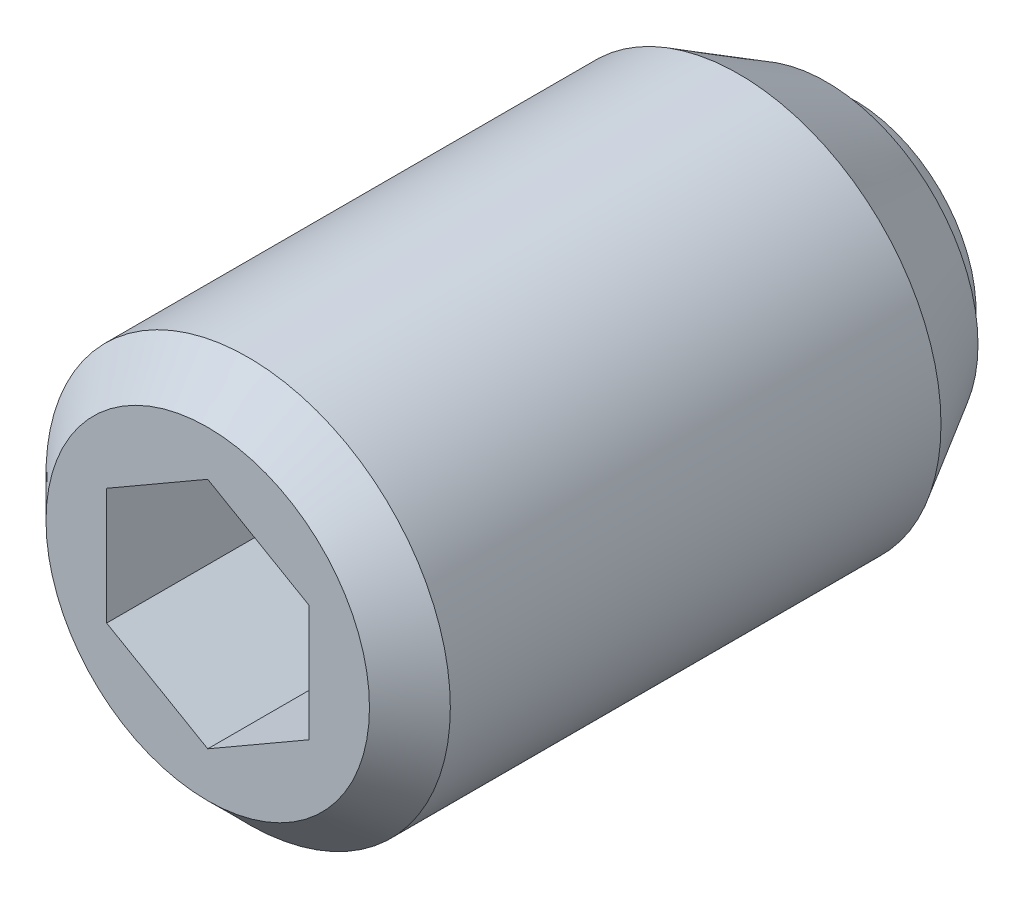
ISO-10303-21;
HEADER;
FILE_DESCRIPTION(('STEP AP214'),'2;1');
FILE_NAME('part.step','',(''),(''),'','','');
FILE_SCHEMA(('AUTOMOTIVE_DESIGN { 1 0 10303 214 1 1 1 1 }'));
ENDSEC;
DATA;
#1=APPLICATION_CONTEXT('core data for automotive mechanical design processes');
#2=APPLICATION_PROTOCOL_DEFINITION('international standard','automotive_design',2000,#1);
#3=PRODUCT_CONTEXT('',#1,'mechanical');
#4=PRODUCT('Part','Part','',(#3));
#5=PRODUCT_RELATED_PRODUCT_CATEGORY('part','',(#4));
#6=PRODUCT_DEFINITION_FORMATION('','',#4);
#7=PRODUCT_DEFINITION_CONTEXT('part definition',#1,'design');
#8=PRODUCT_DEFINITION('design','',#6,#7);
#9=PRODUCT_DEFINITION_SHAPE('','',#8);
#10=(LENGTH_UNIT() NAMED_UNIT(*) SI_UNIT(.MILLI.,.METRE.));
#11=(NAMED_UNIT(*) PLANE_ANGLE_UNIT() SI_UNIT($,.RADIAN.));
#12=(NAMED_UNIT(*) SI_UNIT($,.STERADIAN.) SOLID_ANGLE_UNIT());
#13=UNCERTAINTY_MEASURE_WITH_UNIT(LENGTH_MEASURE(1.E-05),#10,'distance_accuracy_value','');
#14=(GEOMETRIC_REPRESENTATION_CONTEXT(3) GLOBAL_UNCERTAINTY_ASSIGNED_CONTEXT((#13)) GLOBAL_UNIT_ASSIGNED_CONTEXT((#10,
#11,#12)) REPRESENTATION_CONTEXT('',''));
#15=CARTESIAN_POINT('',(0.,0.,0.));
#16=DIRECTION('',(0.,0.,1.));
#17=DIRECTION('',(1.,0.,0.));
#18=AXIS2_PLACEMENT_3D('',#15,#16,#17);
#19=CARTESIAN_POINT('',(2.5,1.44337567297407,13.5));
#20=DIRECTION('',(0.5,0.86602540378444,0.));
#21=DIRECTION('',(0.86602540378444,-0.5,0.));
#22=AXIS2_PLACEMENT_3D('',#19,#20,#21);
#23=PLANE('',#22);
#24=DIRECTION('',(0.,0.,1.));
#25=VECTOR('',#24,1.);
#26=CARTESIAN_POINT('',(2.5,1.44337567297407,13.5));
#27=LINE('',#26,#25);
#28=CARTESIAN_POINT('',(2.5,1.44337567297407,12.));
#29=VERTEX_POINT('',#28);
#30=CARTESIAN_POINT('',(2.5,1.44337567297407,16.));
#31=VERTEX_POINT('',#30);
#32=EDGE_CURVE('E68',#29,#31,#27,.T.);
#33=ORIENTED_EDGE('',*,*,#32,.T.);
#34=DIRECTION('',(-0.86602540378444,0.5,0.));
#35=VECTOR('',#34,1.);
#36=CARTESIAN_POINT('',(2.5,1.44337567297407,16.));
#37=LINE('',#36,#35);
#38=CARTESIAN_POINT('',(0.,2.88675134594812,16.));
#39=VERTEX_POINT('',#38);
#40=EDGE_CURVE('E29',#31,#39,#37,.T.);
#41=ORIENTED_EDGE('',*,*,#40,.T.);
#42=DIRECTION('',(0.,0.,1.));
#43=VECTOR('',#42,1.);
#44=CARTESIAN_POINT('',(0.,2.88675134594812,13.5));
#45=LINE('',#44,#43);
#46=CARTESIAN_POINT('',(0.,2.88675134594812,12.));
#47=VERTEX_POINT('',#46);
#48=EDGE_CURVE('E80',#47,#39,#45,.T.);
#49=ORIENTED_EDGE('',*,*,#48,.F.);
#50=DIRECTION('',(-0.86602540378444,0.5,0.));
#51=VECTOR('',#50,1.);
#52=CARTESIAN_POINT('',(2.5,1.44337567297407,12.));
#53=LINE('',#52,#51);
#54=EDGE_CURVE('E79',#29,#47,#53,.T.);
#55=ORIENTED_EDGE('',*,*,#54,.F.);
#56=EDGE_LOOP('',(#33,#41,#49,#55));
#57=FACE_BOUND('',#56,.T.);
#58=ADVANCED_FACE('F14',(#57),#23,.F.);
#59=CARTESIAN_POINT('',(2.5,-1.44337567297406,13.5));
#60=DIRECTION('',(1.,0.,0.));
#61=DIRECTION('',(0.,-1.,0.));
#62=AXIS2_PLACEMENT_3D('',#59,#60,#61);
#63=PLANE('',#62);
#64=DIRECTION('',(0.,0.,1.));
#65=VECTOR('',#64,1.);
#66=CARTESIAN_POINT('',(2.5,-1.44337567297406,13.5));
#67=LINE('',#66,#65);
#68=CARTESIAN_POINT('',(2.5,-1.44337567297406,12.));
#69=VERTEX_POINT('',#68);
#70=CARTESIAN_POINT('',(2.5,-1.44337567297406,16.));
#71=VERTEX_POINT('',#70);
#72=EDGE_CURVE('E76',#69,#71,#67,.T.);
#73=ORIENTED_EDGE('',*,*,#72,.T.);
#74=DIRECTION('',(0.,1.,0.));
#75=VECTOR('',#74,1.);
#76=CARTESIAN_POINT('',(2.5,-1.44337567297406,16.));
#77=LINE('',#76,#75);
#78=EDGE_CURVE('E75',#71,#31,#77,.T.);
#79=ORIENTED_EDGE('',*,*,#78,.T.);
#80=ORIENTED_EDGE('',*,*,#32,.F.);
#81=DIRECTION('',(0.,1.,0.));
#82=VECTOR('',#81,1.);
#83=CARTESIAN_POINT('',(2.5,-1.44337567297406,12.));
#84=LINE('',#83,#82);
#85=EDGE_CURVE('E72',#69,#29,#84,.T.);
#86=ORIENTED_EDGE('',*,*,#85,.F.);
#87=EDGE_LOOP('',(#73,#79,#80,#86));
#88=FACE_BOUND('',#87,.T.);
#89=ADVANCED_FACE('F70',(#88),#63,.F.);
#90=CARTESIAN_POINT('',(2.5,-1.44337567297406,13.5));
#91=DIRECTION('',(-0.5,0.866025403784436,0.));
#92=DIRECTION('',(0.866025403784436,0.5,0.));
#93=AXIS2_PLACEMENT_3D('',#90,#91,#92);
#94=PLANE('',#93);
#95=DIRECTION('',(0.,0.,1.));
#96=VECTOR('',#95,1.);
#97=CARTESIAN_POINT('',(0.,-2.88675134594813,13.5));
#98=LINE('',#97,#96);
#99=CARTESIAN_POINT('',(0.,-2.88675134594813,12.));
#100=VERTEX_POINT('',#99);
#101=CARTESIAN_POINT('',(0.,-2.88675134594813,16.));
#102=VERTEX_POINT('',#101);
#103=EDGE_CURVE('E122',#100,#102,#98,.T.);
#104=ORIENTED_EDGE('',*,*,#103,.T.);
#105=DIRECTION('',(-0.866025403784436,-0.5,0.));
#106=VECTOR('',#105,1.);
#107=CARTESIAN_POINT('',(2.5,-1.44337567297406,16.));
#108=LINE('',#107,#106);
#109=EDGE_CURVE('E113',#71,#102,#108,.T.);
#110=ORIENTED_EDGE('',*,*,#109,.F.);
#111=ORIENTED_EDGE('',*,*,#72,.F.);
#112=DIRECTION('',(0.866025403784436,0.5,0.));
#113=VECTOR('',#112,1.);
#114=CARTESIAN_POINT('',(0.,-2.88675134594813,12.));
#115=LINE('',#114,#113);
#116=EDGE_CURVE('E89',#100,#69,#115,.T.);
#117=ORIENTED_EDGE('',*,*,#116,.F.);
#118=EDGE_LOOP('',(#104,#110,#111,#117));
#119=FACE_BOUND('',#118,.T.);
#120=ADVANCED_FACE('F147',(#119),#94,.T.);
#121=CARTESIAN_POINT('',(-2.5,-1.44337567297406,13.5));
#122=DIRECTION('',(-0.5,-0.866025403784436,0.));
#123=DIRECTION('',(-0.866025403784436,0.5,0.));
#124=AXIS2_PLACEMENT_3D('',#121,#122,#123);
#125=PLANE('',#124);
#126=DIRECTION('',(0.,0.,1.));
#127=VECTOR('',#126,1.);
#128=CARTESIAN_POINT('',(-2.5,-1.44337567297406,13.5));
#129=LINE('',#128,#127);
#130=CARTESIAN_POINT('',(-2.5,-1.44337567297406,12.));
#131=VERTEX_POINT('',#130);
#132=CARTESIAN_POINT('',(-2.5,-1.44337567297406,16.));
#133=VERTEX_POINT('',#132);
#134=EDGE_CURVE('E120',#131,#133,#129,.T.);
#135=ORIENTED_EDGE('',*,*,#134,.T.);
#136=DIRECTION('',(0.866025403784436,-0.5,0.));
#137=VECTOR('',#136,1.);
#138=CARTESIAN_POINT('',(-2.5,-1.44337567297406,16.));
#139=LINE('',#138,#137);
#140=EDGE_CURVE('E111',#133,#102,#139,.T.);
#141=ORIENTED_EDGE('',*,*,#140,.T.);
#142=ORIENTED_EDGE('',*,*,#103,.F.);
#143=DIRECTION('',(0.866025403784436,-0.5,0.));
#144=VECTOR('',#143,1.);
#145=CARTESIAN_POINT('',(-2.5,-1.44337567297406,12.));
#146=LINE('',#145,#144);
#147=EDGE_CURVE('E101',#131,#100,#146,.T.);
#148=ORIENTED_EDGE('',*,*,#147,.F.);
#149=EDGE_LOOP('',(#135,#141,#142,#148));
#150=FACE_BOUND('',#149,.T.);
#151=ADVANCED_FACE('F157',(#150),#125,.F.);
#152=CARTESIAN_POINT('',(-2.5,-1.44337567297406,13.5));
#153=DIRECTION('',(1.,0.,0.));
#154=DIRECTION('',(0.,-1.,0.));
#155=AXIS2_PLACEMENT_3D('',#152,#153,#154);
#156=PLANE('',#155);
#157=DIRECTION('',(0.,0.,1.));
#158=VECTOR('',#157,1.);
#159=CARTESIAN_POINT('',(-2.5,1.44337567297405,13.5));
#160=LINE('',#159,#158);
#161=CARTESIAN_POINT('',(-2.5,1.44337567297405,12.));
#162=VERTEX_POINT('',#161);
#163=CARTESIAN_POINT('',(-2.5,1.44337567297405,16.));
#164=VERTEX_POINT('',#163);
#165=EDGE_CURVE('E37',#162,#164,#160,.T.);
#166=ORIENTED_EDGE('',*,*,#165,.T.);
#167=DIRECTION('',(0.,1.,0.));
#168=VECTOR('',#167,1.);
#169=CARTESIAN_POINT('',(-2.5,-1.44337567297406,16.));
#170=LINE('',#169,#168);
#171=EDGE_CURVE('E108',#133,#164,#170,.T.);
#172=ORIENTED_EDGE('',*,*,#171,.F.);
#173=ORIENTED_EDGE('',*,*,#134,.F.);
#174=DIRECTION('',(0.,-1.,0.));
#175=VECTOR('',#174,1.);
#176=CARTESIAN_POINT('',(-2.5,1.44337567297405,12.));
#177=LINE('',#176,#175);
#178=EDGE_CURVE('E98',#162,#131,#177,.T.);
#179=ORIENTED_EDGE('',*,*,#178,.F.);
#180=EDGE_LOOP('',(#166,#172,#173,#179));
#181=FACE_BOUND('',#180,.T.);
#182=ADVANCED_FACE('F153',(#181),#156,.T.);
#183=CARTESIAN_POINT('',(-2.5,1.44337567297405,13.5));
#184=DIRECTION('',(0.5,-0.866025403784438,0.));
#185=DIRECTION('',(-0.866025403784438,-0.5,0.));
#186=AXIS2_PLACEMENT_3D('',#183,#184,#185);
#187=PLANE('',#186);
#188=ORIENTED_EDGE('',*,*,#165,.F.);
#189=DIRECTION('',(-0.866025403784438,-0.5,0.));
#190=VECTOR('',#189,1.);
#191=CARTESIAN_POINT('',(0.,2.88675134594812,12.));
#192=LINE('',#191,#190);
#193=EDGE_CURVE('E84',#47,#162,#192,.T.);
#194=ORIENTED_EDGE('',*,*,#193,.F.);
#195=ORIENTED_EDGE('',*,*,#48,.T.);
#196=DIRECTION('',(0.866025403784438,0.5,0.));
#197=VECTOR('',#196,1.);
#198=CARTESIAN_POINT('',(-2.5,1.44337567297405,16.));
#199=LINE('',#198,#197);
#200=EDGE_CURVE('E105',#164,#39,#199,.T.);
#201=ORIENTED_EDGE('',*,*,#200,.F.);
#202=EDGE_LOOP('',(#188,#194,#195,#201));
#203=FACE_BOUND('',#202,.T.);
#204=ADVANCED_FACE('F150',(#203),#187,.T.);
#205=CARTESIAN_POINT('',(0.,0.,15.75));
#206=DIRECTION('',(0.,0.,-1.));
#207=DIRECTION('',(1.,0.,0.));
#208=AXIS2_PLACEMENT_3D('',#205,#206,#207);
#209=CYLINDRICAL_SURFACE('',#208,5.);
#210=CARTESIAN_POINT('',(0.,0.,15.));
#211=DIRECTION('',(0.,0.,-1.));
#212=DIRECTION('',(1.,0.,0.));
#213=AXIS2_PLACEMENT_3D('',#210,#211,#212);
#214=CIRCLE('',#213,5.);
#215=CARTESIAN_POINT('',(5.,0.,15.));
#216=VERTEX_POINT('',#215);
#217=EDGE_CURVE('E9',#216,#216,#214,.T.);
#218=ORIENTED_EDGE('',*,*,#217,.T.);
#219=EDGE_LOOP('',(#218));
#220=FACE_BOUND('',#219,.T.);
#221=CARTESIAN_POINT('',(0.,0.,2.86506350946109));
#222=DIRECTION('',(0.,0.,-1.));
#223=DIRECTION('',(-1.,0.,0.));
#224=AXIS2_PLACEMENT_3D('',#221,#222,#223);
#225=CIRCLE('',#224,5.);
#226=CARTESIAN_POINT('',(-5.,0.,2.86506350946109));
#227=VERTEX_POINT('',#226);
#228=EDGE_CURVE('E260',#227,#227,#225,.T.);
#229=ORIENTED_EDGE('',*,*,#228,.F.);
#230=EDGE_LOOP('',(#229));
#231=FACE_BOUND('',#230,.T.);
#232=ADVANCED_FACE('F16',(#220,#231),#209,.T.);
#233=CARTESIAN_POINT('',(0.,0.,15.));
#234=DIRECTION('',(0.,0.,-1.));
#235=DIRECTION('',(1.,0.,0.));
#236=AXIS2_PLACEMENT_3D('',#233,#234,#235);
#237=CONICAL_SURFACE('',#236,5.,0.785398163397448);
#238=CARTESIAN_POINT('',(0.,0.,16.));
#239=DIRECTION('',(0.,0.,-1.));
#240=DIRECTION('',(1.,0.,0.));
#241=AXIS2_PLACEMENT_3D('',#238,#239,#240);
#242=CIRCLE('',#241,4.);
#243=CARTESIAN_POINT('',(4.,0.,16.));
#244=VERTEX_POINT('',#243);
#245=EDGE_CURVE('E22',#244,#244,#242,.T.);
#246=ORIENTED_EDGE('',*,*,#245,.T.);
#247=EDGE_LOOP('',(#246));
#248=FACE_BOUND('',#247,.T.);
#249=ORIENTED_EDGE('',*,*,#217,.F.);
#250=EDGE_LOOP('',(#249));
#251=FACE_BOUND('',#250,.T.);
#252=ADVANCED_FACE('F127',(#248,#251),#237,.T.);
#253=CARTESIAN_POINT('',(0.,0.,16.));
#254=DIRECTION('',(0.,0.,-1.));
#255=DIRECTION('',(1.,0.,0.));
#256=AXIS2_PLACEMENT_3D('',#253,#254,#255);
#257=PLANE('',#256);
#258=ORIENTED_EDGE('',*,*,#200,.T.);
#259=ORIENTED_EDGE('',*,*,#40,.F.);
#260=ORIENTED_EDGE('',*,*,#78,.F.);
#261=ORIENTED_EDGE('',*,*,#109,.T.);
#262=ORIENTED_EDGE('',*,*,#140,.F.);
#263=ORIENTED_EDGE('',*,*,#171,.T.);
#264=EDGE_LOOP('',(#258,#259,#260,#261,#262,#263));
#265=FACE_BOUND('',#264,.T.);
#266=ORIENTED_EDGE('',*,*,#245,.F.);
#267=EDGE_LOOP('',(#266));
#268=FACE_BOUND('',#267,.T.);
#269=ADVANCED_FACE('F130',(#265,#268),#257,.F.);
#270=CARTESIAN_POINT('',(2.5,1.44337567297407,12.));
#271=DIRECTION('',(0.,0.,1.));
#272=DIRECTION('',(1.,0.,0.));
#273=AXIS2_PLACEMENT_3D('',#270,#271,#272);
#274=PLANE('',#273);
#275=ORIENTED_EDGE('',*,*,#85,.T.);
#276=ORIENTED_EDGE('',*,*,#54,.T.);
#277=ORIENTED_EDGE('',*,*,#193,.T.);
#278=ORIENTED_EDGE('',*,*,#178,.T.);
#279=ORIENTED_EDGE('',*,*,#147,.T.);
#280=ORIENTED_EDGE('',*,*,#116,.T.);
#281=EDGE_LOOP('',(#275,#276,#277,#278,#279,#280));
#282=FACE_BOUND('',#281,.T.);
#283=ADVANCED_FACE('F86',(#282),#274,.T.);
#284=CARTESIAN_POINT('',(0.,0.,0.));
#285=DIRECTION('',(0.,0.,-1.));
#286=DIRECTION('',(-1.,0.,0.));
#287=AXIS2_PLACEMENT_3D('',#284,#285,#286);
#288=PLANE('',#287);
#289=CARTESIAN_POINT('',(0.,0.,0.));
#290=DIRECTION('',(0.,0.,-1.));
#291=DIRECTION('',(-1.,0.,0.));
#292=AXIS2_PLACEMENT_3D('',#289,#290,#291);
#293=CIRCLE('',#292,3.00166620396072);
#294=CARTESIAN_POINT('',(-3.00166620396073,0.,0.));
#295=VERTEX_POINT('',#294);
#296=EDGE_CURVE('E90',#295,#295,#293,.T.);
#297=ORIENTED_EDGE('',*,*,#296,.T.);
#298=EDGE_LOOP('',(#297));
#299=FACE_BOUND('',#298,.T.);
#300=ADVANCED_FACE('F139',(#299),#288,.T.);
#301=CARTESIAN_POINT('',(0.,0.,1.8));
#302=DIRECTION('',(0.,0.,-1.));
#303=DIRECTION('',(-1.,0.,0.));
#304=AXIS2_PLACEMENT_3D('',#301,#302,#303);
#305=SPHERICAL_SURFACE('',#304,3.5);
#306=CARTESIAN_POINT('',(0.,0.,0.7));
#307=DIRECTION('',(0.,0.,-1.));
#308=DIRECTION('',(-1.,0.,0.));
#309=AXIS2_PLACEMENT_3D('',#306,#307,#308);
#310=CIRCLE('',#309,3.32264954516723);
#311=CARTESIAN_POINT('',(-3.32264954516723,0.,0.7));
#312=VERTEX_POINT('',#311);
#313=EDGE_CURVE('E93',#312,#312,#310,.T.);
#314=CARTESIAN_POINT('',(-3.32264954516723,0.,0.7));
#315=CARTESIAN_POINT('',(-3.32012332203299,0.,0.692369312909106));
#316=CARTESIAN_POINT('',(-3.31757081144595,0.,0.68474732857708));
#317=CARTESIAN_POINT('',(-3.31241333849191,0.,0.669521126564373));
#318=CARTESIAN_POINT('',(-3.30980837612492,0.,0.661916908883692));
#319=CARTESIAN_POINT('',(-3.30454612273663,0.,0.646726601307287));
#320=CARTESIAN_POINT('',(-3.30188883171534,0.,0.639140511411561));
#321=CARTESIAN_POINT('',(-3.29652204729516,0.,0.623986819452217));
#322=CARTESIAN_POINT('',(-3.29381255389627,0.,0.616419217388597));
#323=CARTESIAN_POINT('',(-3.28834149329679,0.,0.601302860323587));
#324=CARTESIAN_POINT('',(-3.28557992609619,0.,0.593754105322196));
#325=CARTESIAN_POINT('',(-3.28000484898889,0.,0.578675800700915));
#326=CARTESIAN_POINT('',(-3.27719133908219,0.,0.571146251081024));
#327=CARTESIAN_POINT('',(-3.27151251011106,0.,0.556106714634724));
#328=CARTESIAN_POINT('',(-3.26864719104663,0.,0.548596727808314));
#329=CARTESIAN_POINT('',(-3.26286487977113,0.,0.533596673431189));
#330=CARTESIAN_POINT('',(-3.25994788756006,0.,0.526106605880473));
#331=CARTESIAN_POINT('',(-3.25406236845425,0.,0.511146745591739));
#332=CARTESIAN_POINT('',(-3.25109384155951,0.,0.503676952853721));
#333=CARTESIAN_POINT('',(-3.24510539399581,0.,0.488757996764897));
#334=CARTESIAN_POINT('',(-3.24208547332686,0.,0.481308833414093));
#335=CARTESIAN_POINT('',(-3.23599438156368,0.,0.466431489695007));
#336=CARTESIAN_POINT('',(-3.23292321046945,0.,0.459003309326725));
#337=CARTESIAN_POINT('',(-3.22672976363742,0.,0.444168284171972));
#338=CARTESIAN_POINT('',(-3.22360748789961,0.,0.436761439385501));
#339=CARTESIAN_POINT('',(-3.21731197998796,0.,0.421969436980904));
#340=CARTESIAN_POINT('',(-3.2141387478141,0.,0.414584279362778));
#341=CARTESIAN_POINT('',(-3.20774147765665,0.,0.399836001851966));
#342=CARTESIAN_POINT('',(-3.20451743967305,0.,0.39247288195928));
#343=CARTESIAN_POINT('',(-3.19801871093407,0.,0.377769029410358));
#344=CARTESIAN_POINT('',(-3.19474402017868,0.,0.370428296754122));
#345=CARTESIAN_POINT('',(-3.18814414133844,0.,0.35576956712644));
#346=CARTESIAN_POINT('',(-3.18481895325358,0.,0.348451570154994));
#347=CARTESIAN_POINT('',(-3.17811823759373,0.,0.333838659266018));
#348=CARTESIAN_POINT('',(-3.17474271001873,0.,0.326543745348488));
#349=CARTESIAN_POINT('',(-3.16794147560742,0.,0.311977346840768));
#350=CARTESIAN_POINT('',(-3.1645157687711,0.,0.304705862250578));
#351=CARTESIAN_POINT('',(-3.15761433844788,0.,0.290186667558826));
#352=CARTESIAN_POINT('',(-3.15413861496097,0.,0.282938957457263));
#353=CARTESIAN_POINT('',(-3.14713731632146,0.,0.268467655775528));
#354=CARTESIAN_POINT('',(-3.14361174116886,0.,0.261244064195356));
#355=CARTESIAN_POINT('',(-3.13651090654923,0.,0.246821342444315));
#356=CARTESIAN_POINT('',(-3.13293564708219,0.,0.239622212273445));
#357=CARTESIAN_POINT('',(-3.12573561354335,0.,0.225248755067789));
#358=CARTESIAN_POINT('',(-3.12211083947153,0.,0.218074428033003));
#359=CARTESIAN_POINT('',(-3.11481194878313,0.,0.203750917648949));
#360=CARTESIAN_POINT('',(-3.11113783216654,0.,0.196601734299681));
#361=CARTESIAN_POINT('',(-3.10374043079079,0.,0.182328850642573));
#362=CARTESIAN_POINT('',(-3.10001714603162,0.,0.175205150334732));
#363=CARTESIAN_POINT('',(-3.09252158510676,0.,0.1609835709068));
#364=CARTESIAN_POINT('',(-3.08874930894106,0.,0.153885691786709));
#365=CARTESIAN_POINT('',(-3.08115594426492,0.,0.139716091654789));
#366=CARTESIAN_POINT('',(-3.07733485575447,0.,0.13264437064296));
#367=CARTESIAN_POINT('',(-3.06964404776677,0.,0.118527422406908));
#368=CARTESIAN_POINT('',(-3.06577432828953,0.,0.111482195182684));
#369=CARTESIAN_POINT('',(-3.05798644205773,0.,0.0974185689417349));
#370=CARTESIAN_POINT('',(-3.05406827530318,0.,0.0904001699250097));
#371=CARTESIAN_POINT('',(-3.04618368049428,0.,0.0763905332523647));
#372=CARTESIAN_POINT('',(-3.04221725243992,0.,0.0693992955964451));
#373=CARTESIAN_POINT('',(-3.03423632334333,0.,0.0554443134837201));
#374=CARTESIAN_POINT('',(-3.03022182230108,0.,0.0484805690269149));
#375=CARTESIAN_POINT('',(-3.02214493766,0.,0.0345809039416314));
#376=CARTESIAN_POINT('',(-3.01808255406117,0.,0.0276449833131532));
#377=CARTESIAN_POINT('',(-3.00991009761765,0.,0.0138012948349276));
#378=CARTESIAN_POINT('',(-3.00580002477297,0.,0.00689352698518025));
#379=CARTESIAN_POINT('',(-3.00166620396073,0.,0.));
#380=B_SPLINE_CURVE_WITH_KNOTS('',3,(#314,#315,#316,#317,#318,#319,#320,#321,#322,#323,#324,
#325,#326,#327,#328,#329,#330,#331,#332,#333,#334,#335,#336,#337,#338,#339,#340,#341,#342,#343,
#344,#345,#346,#347,#348,#349,#350,#351,#352,#353,#354,#355,#356,#357,#358,#359,#360,#361,#362,
#363,#364,#365,#366,#367,#368,#369,#370,#371,#372,#373,#374,#375,#376,#377,#378,#379),
.UNSPECIFIED.,.F.,.F.,(4,2,2,2,2,2,2,2,2,2,2,2,2,2,2,2,2,2,2,2,2,2,2,2,2,2,2,2,2,2,2,2,4),(0.,
0.0241139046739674,0.048227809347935,0.0723417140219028,0.0964556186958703,0.120569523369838,
0.144683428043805,0.168797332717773,0.192911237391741,0.217025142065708,0.241139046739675,
0.265252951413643,0.289366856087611,0.313480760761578,0.337594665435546,0.361708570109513,
0.385822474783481,0.409936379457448,0.434050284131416,0.458164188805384,0.482278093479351,
0.506391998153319,0.530505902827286,0.554619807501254,0.578733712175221,0.602847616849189,
0.626961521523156,0.651075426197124,0.675189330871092,0.699303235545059,0.723417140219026,
0.747531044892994,0.771644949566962),.UNSPECIFIED.);
#381=EDGE_CURVE('BSEAM223',#312,#295,#380,.T.);
#382=ORIENTED_EDGE('',*,*,#313,.T.);
#383=ORIENTED_EDGE('',*,*,#296,.F.);
#384=ORIENTED_EDGE('',*,*,#381,.T.);
#385=ORIENTED_EDGE('',*,*,#381,.F.);
#386=EDGE_LOOP('',(#382,#384,#383,#385));
#387=FACE_BOUND('',#386,.T.);
#388=ADVANCED_FACE('F223',(#387),#305,.T.);
#389=CARTESIAN_POINT('',(-3.32264954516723,0.,0.7));
#390=DIRECTION('',(0.,0.,-1.));
#391=DIRECTION('',(-1.,0.,0.));
#392=AXIS2_PLACEMENT_3D('',#389,#390,#391);
#393=PLANE('',#392);
#394=CARTESIAN_POINT('',(0.,0.,0.7));
#395=DIRECTION('',(0.,0.,-1.));
#396=DIRECTION('',(-1.,0.,0.));
#397=AXIS2_PLACEMENT_3D('',#394,#395,#396);
#398=CIRCLE('',#397,3.75);
#399=CARTESIAN_POINT('',(-3.75,0.,0.7));
#400=VERTEX_POINT('',#399);
#401=EDGE_CURVE('E263',#400,#400,#398,.T.);
#402=ORIENTED_EDGE('',*,*,#401,.T.);
#403=EDGE_LOOP('',(#402));
#404=FACE_BOUND('',#403,.T.);
#405=ORIENTED_EDGE('',*,*,#313,.F.);
#406=EDGE_LOOP('',(#405));
#407=FACE_BOUND('',#406,.T.);
#408=ADVANCED_FACE('F232',(#404,#407),#393,.T.);
#409=CARTESIAN_POINT('',(0.,0.,0.7));
#410=DIRECTION('',(0.,0.,1.));
#411=DIRECTION('',(1.,0.,0.));
#412=AXIS2_PLACEMENT_3D('',#409,#410,#411);
#413=CONICAL_SURFACE('',#412,3.75,0.523598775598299);
#414=ORIENTED_EDGE('',*,*,#228,.T.);
#415=EDGE_LOOP('',(#414));
#416=FACE_BOUND('',#415,.T.);
#417=ORIENTED_EDGE('',*,*,#401,.F.);
#418=EDGE_LOOP('',(#417));
#419=FACE_BOUND('',#418,.T.);
#420=ADVANCED_FACE('F242',(#416,#419),#413,.T.);
#421=CLOSED_SHELL('',(#58,#89,#120,#151,#182,#204,#232,#252,#269,#283,#300,#388,#408,#420));
#422=MANIFOLD_SOLID_BREP('B1',#421);
#423=ADVANCED_BREP_SHAPE_REPRESENTATION('',(#18,#422),#14);
#424=SHAPE_DEFINITION_REPRESENTATION(#9,#423);
ENDSEC;
END-ISO-10303-21;
